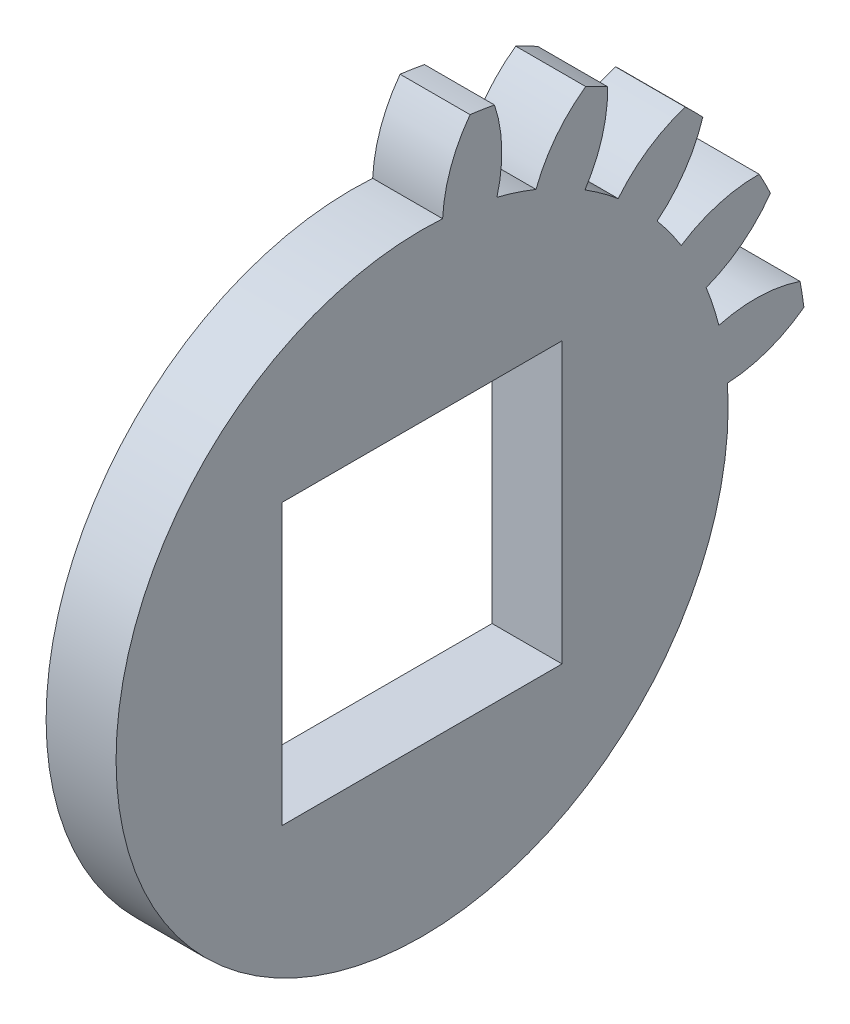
from build123d import *

# Parameters (mm, degrees)
BASPROSKE_W        = 3.175
BASPROSKE_H        = 17.4625
TOOTHCUT_DEPTH     = 25.898964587
TEETHCUTS_COUNT    = 20
TEETHCUTS_ANGLE    = 342
BORSKE_R           = 1.5875
BORE_DEPTH         = 50.8000508
CUT_EXTRUDE1_DEPTH = 5.08
SKETCH2_W          = 12.7
SKETCH2_H          = 12.7
CUT_EXTRUDE2_DEPTH = 5.08
SCALE2_SCALE       = 0.5


with BuildPart() as part:
    # BasProSke → Base-Revolve (revolve)
    with BuildSketch(Plane(origin=(0, 0, 0), x_dir=(1, 0, 0), z_dir=(0, 1, 0)), mode=Mode.PRIVATE) as base_revolve_sk:
        with Locations((1.5875, 8.73125)):
            Rectangle(BASPROSKE_W, BASPROSKE_H)
    revolve(base_revolve_sk.sketch.rotate(Axis((-10, 0, 0), (1, 0, 0)), 180), axis=Axis((-10, 0, 0), (1, 0, 0)))

    # TooCutSke → ToothCut (cut, through all)
    with BuildSketch(Plane(origin=(0, 0, 0), x_dir=(0, 0, -1), z_dir=(1, 0, 0))):
        with BuildLine():
            ThreePointArc((0.930751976, 13.858134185), (0, 13.889355), (-0.930751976, 13.858134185))
            ThreePointArc((-0.930751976, 13.858134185), (-1.300917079, 15.698306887), (-2.192883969, 17.349867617))
            ThreePointArc((-2.192883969, 17.349867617), (0, 17.4879), (2.192883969, 17.349867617))
            ThreePointArc((2.192883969, 17.349867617), (1.300917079, 15.698306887), (0.930751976, 13.858134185))
        make_face()
    toothcut = extrude(amount=TOOTHCUT_DEPTH, mode=Mode.SUBTRACT)

    # TeethCuts: ToothCut ×20 about axis
    teethcuts_axis = Axis((-10, 0, 0), (1, 0, 0))
    for i in range(1, TEETHCUTS_COUNT):
        add(toothcut.rotate(teethcuts_axis, i * TEETHCUTS_ANGLE / (TEETHCUTS_COUNT - 1)), mode=Mode.SUBTRACT)

    # BorSke → Bore (cut, symmetric)
    with BuildSketch(Plane(origin=(0, 0, 0), x_dir=(0, 0, -1), z_dir=(1, 0, 0))):
        with Locations(Location((0, 0, 0), (0, 0, 180))):
            Circle(BORSKE_R)
    extrude(amount=BORE_DEPTH, both=True, mode=Mode.SUBTRACT)

    # Sketch1 → Cut-Extrude1 (cut)
    with BuildSketch(Plane(origin=(0, 0, 0), x_dir=(0, 0, -1), z_dir=(1, 0, 0))):
        with BuildLine():
            Line((0, 17.4625), (0, 13.889355))
            ThreePointArc((0, 13.889355), (-9.821257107, -9.821257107), (13.889355, 0))
            Line((13.889355, 0), (17.4625, 0))
            ThreePointArc((17.4625, 0), (-12.347852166, -12.347852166), (0, 17.4625))
        make_face()
    extrude(amount=CUT_EXTRUDE1_DEPTH, mode=Mode.SUBTRACT)

    # Sketch2 → Cut-Extrude2 (cut)
    with BuildSketch(Plane(origin=(3.175, 0, 0), x_dir=(0, 0, -1), z_dir=(1, 0, 0))):
        Rectangle(SKETCH2_W, SKETCH2_H)
    extrude(amount=-CUT_EXTRUDE2_DEPTH, mode=Mode.SUBTRACT)


with BuildPart() as part_1:
    # Scale2: scaled about (1.5875, 0.799092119, -0.799092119)
    add(part.part.scale(SCALE2_SCALE).moved(Location((0.79375, 0.399546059, -0.399546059))))


solid = part_1.part
